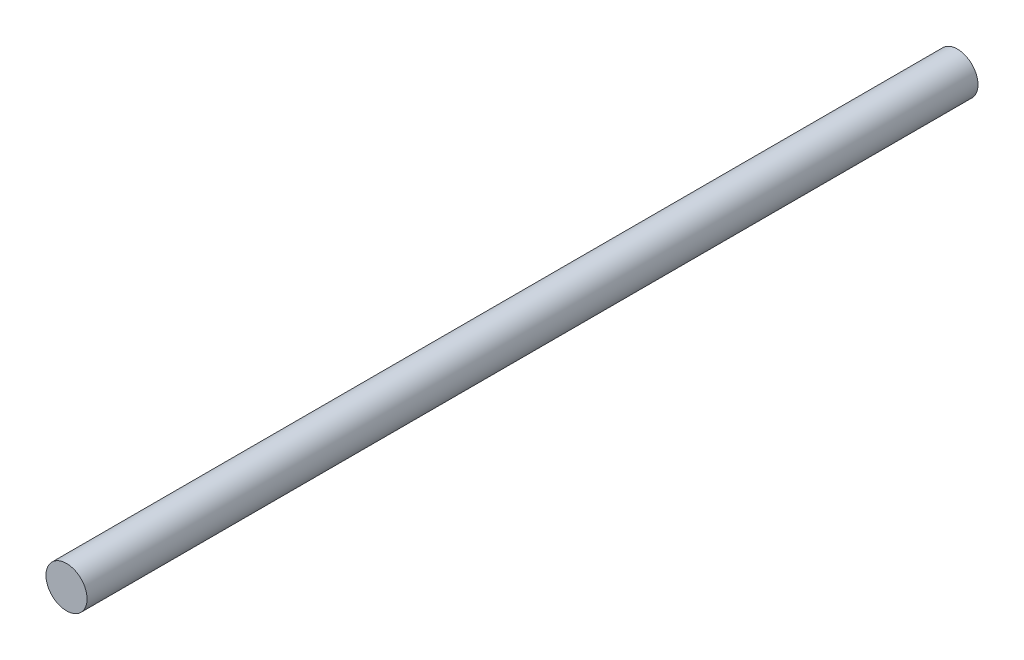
from build123d import *

# Parameters (mm, degrees)
SKETCH1_R           = 30
BOSS_EXTRUDE1_DEPTH = 1300


with BuildPart() as part:
    # Sketch1 → Boss-Extrude1 (new body)
    with BuildSketch(Plane.XY):
        Circle(SKETCH1_R)
    extrude(amount=-BOSS_EXTRUDE1_DEPTH)


solid = part.part
